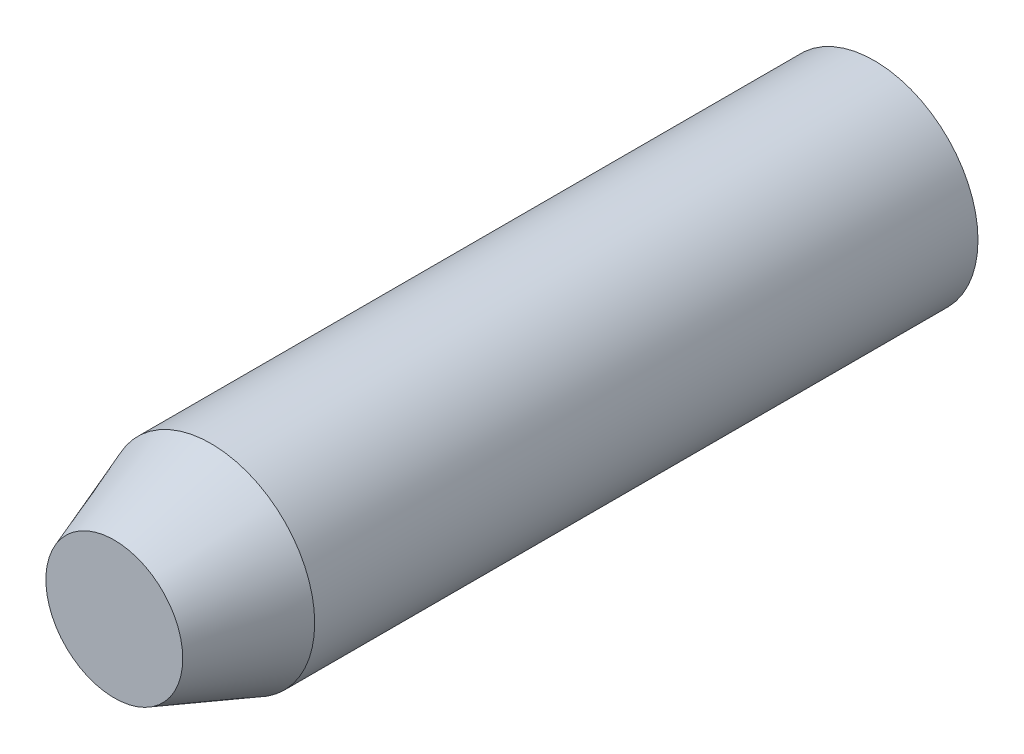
ISO-10303-21;
HEADER;
FILE_DESCRIPTION(('STEP AP214'),'2;1');
FILE_NAME('part.step','',(''),(''),'','','');
FILE_SCHEMA(('AUTOMOTIVE_DESIGN { 1 0 10303 214 1 1 1 1 }'));
ENDSEC;
DATA;
#1=APPLICATION_CONTEXT('core data for automotive mechanical design processes');
#2=APPLICATION_PROTOCOL_DEFINITION('international standard','automotive_design',2000,#1);
#3=PRODUCT_CONTEXT('',#1,'mechanical');
#4=PRODUCT('Part','Part','',(#3));
#5=PRODUCT_RELATED_PRODUCT_CATEGORY('part','',(#4));
#6=PRODUCT_DEFINITION_FORMATION('','',#4);
#7=PRODUCT_DEFINITION_CONTEXT('part definition',#1,'design');
#8=PRODUCT_DEFINITION('design','',#6,#7);
#9=PRODUCT_DEFINITION_SHAPE('','',#8);
#10=(LENGTH_UNIT() NAMED_UNIT(*) SI_UNIT(.MILLI.,.METRE.));
#11=(NAMED_UNIT(*) PLANE_ANGLE_UNIT() SI_UNIT($,.RADIAN.));
#12=(NAMED_UNIT(*) SI_UNIT($,.STERADIAN.) SOLID_ANGLE_UNIT());
#13=UNCERTAINTY_MEASURE_WITH_UNIT(LENGTH_MEASURE(1.E-05),#10,'distance_accuracy_value','');
#14=(GEOMETRIC_REPRESENTATION_CONTEXT(3) GLOBAL_UNCERTAINTY_ASSIGNED_CONTEXT((#13)) GLOBAL_UNIT_ASSIGNED_CONTEXT((#10,
#11,#12)) REPRESENTATION_CONTEXT('',''));
#15=CARTESIAN_POINT('',(0.,0.,0.));
#16=DIRECTION('',(0.,0.,1.));
#17=DIRECTION('',(1.,0.,0.));
#18=AXIS2_PLACEMENT_3D('',#15,#16,#17);
#19=CARTESIAN_POINT('',(0.,0.,11.));
#20=DIRECTION('',(0.,0.,-1.));
#21=DIRECTION('',(-1.,0.,0.));
#22=AXIS2_PLACEMENT_3D('',#19,#20,#21);
#23=CYLINDRICAL_SURFACE('',#22,1.5);
#24=CARTESIAN_POINT('',(0.,0.,9.59999999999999));
#25=DIRECTION('',(0.,0.,1.));
#26=DIRECTION('',(1.,0.,0.));
#27=AXIS2_PLACEMENT_3D('',#24,#25,#26);
#28=CIRCLE('',#27,1.5);
#29=CARTESIAN_POINT('',(1.5,0.,9.59999999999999));
#30=VERTEX_POINT('',#29);
#31=EDGE_CURVE('E10',#30,#30,#28,.F.);
#32=ORIENTED_EDGE('',*,*,#31,.T.);
#33=EDGE_LOOP('',(#32));
#34=FACE_BOUND('',#33,.T.);
#35=CARTESIAN_POINT('',(0.,0.,0.));
#36=DIRECTION('',(0.,0.,1.));
#37=DIRECTION('',(1.,0.,0.));
#38=AXIS2_PLACEMENT_3D('',#35,#36,#37);
#39=CIRCLE('',#38,1.5);
#40=CARTESIAN_POINT('',(1.5,0.,0.));
#41=VERTEX_POINT('',#40);
#42=EDGE_CURVE('E40',#41,#41,#39,.T.);
#43=ORIENTED_EDGE('',*,*,#42,.T.);
#44=EDGE_LOOP('',(#43));
#45=FACE_BOUND('',#44,.T.);
#46=ADVANCED_FACE('F29',(#34,#45),#23,.T.);
#47=CARTESIAN_POINT('',(0.,0.,11.));
#48=DIRECTION('',(0.,0.,1.));
#49=DIRECTION('',(1.,0.,0.));
#50=AXIS2_PLACEMENT_3D('',#47,#48,#49);
#51=PLANE('',#50);
#52=CARTESIAN_POINT('',(0.,0.,11.));
#53=DIRECTION('',(0.,0.,1.));
#54=DIRECTION('',(1.,0.,0.));
#55=AXIS2_PLACEMENT_3D('',#52,#53,#54);
#56=CIRCLE('',#55,0.990441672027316);
#57=CARTESIAN_POINT('',(0.990441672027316,0.,11.));
#58=VERTEX_POINT('',#57);
#59=EDGE_CURVE('E36',#58,#58,#56,.T.);
#60=ORIENTED_EDGE('',*,*,#59,.T.);
#61=EDGE_LOOP('',(#60));
#62=FACE_BOUND('',#61,.T.);
#63=ADVANCED_FACE('F50',(#62),#51,.T.);
#64=CARTESIAN_POINT('',(0.,0.,0.));
#65=DIRECTION('',(0.,0.,1.));
#66=DIRECTION('',(1.,0.,0.));
#67=AXIS2_PLACEMENT_3D('',#64,#65,#66);
#68=PLANE('',#67);
#69=ORIENTED_EDGE('',*,*,#42,.F.);
#70=EDGE_LOOP('',(#69));
#71=FACE_BOUND('',#70,.T.);
#72=ADVANCED_FACE('F48',(#71),#68,.F.);
#73=CARTESIAN_POINT('',(0.,0.,11.));
#74=DIRECTION('',(0.,0.,-1.));
#75=DIRECTION('',(-1.,0.,0.));
#76=AXIS2_PLACEMENT_3D('',#73,#74,#75);
#77=CONICAL_SURFACE('',#76,0.990441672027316,0.349065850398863);
#78=ORIENTED_EDGE('',*,*,#31,.F.);
#79=EDGE_LOOP('',(#78));
#80=FACE_BOUND('',#79,.T.);
#81=ORIENTED_EDGE('',*,*,#59,.F.);
#82=EDGE_LOOP('',(#81));
#83=FACE_BOUND('',#82,.T.);
#84=ADVANCED_FACE('F31',(#80,#83),#77,.T.);
#85=CLOSED_SHELL('',(#46,#63,#72,#84));
#86=MANIFOLD_SOLID_BREP('B2',#85);
#87=ADVANCED_BREP_SHAPE_REPRESENTATION('',(#18,#86),#14);
#88=SHAPE_DEFINITION_REPRESENTATION(#9,#87);
ENDSEC;
END-ISO-10303-21;
